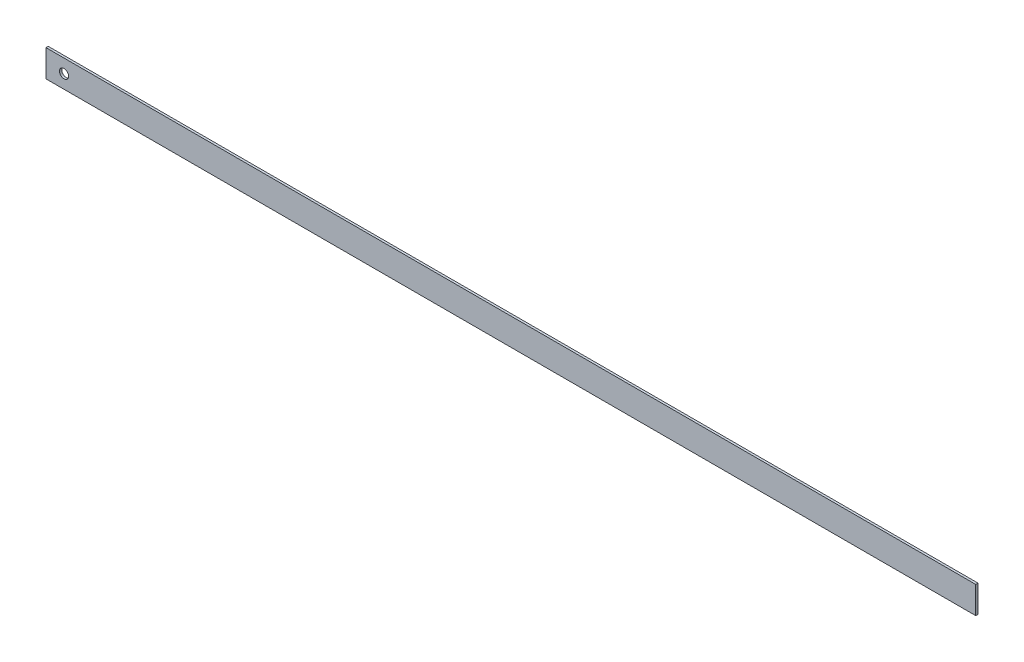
from build123d import *

# Parameters (mm, degrees)
SKETCH1_W           = 654.05
SKETCH1_H           = 19.05
SKETCH1_R           = 3.175
BOSS_EXTRUDE1_DEPTH = 1.5875


with BuildPart() as part:
    # Sketch1 → Boss-Extrude1 (new body)
    with BuildSketch(Plane.XY):
        with Locations((-327.025, 9.525)):
            Rectangle(SKETCH1_W, SKETCH1_H)
        with Locations((-641.35, 9.525)):
            Circle(SKETCH1_R, mode=Mode.SUBTRACT)
    extrude(amount=BOSS_EXTRUDE1_DEPTH)


solid = part.part
